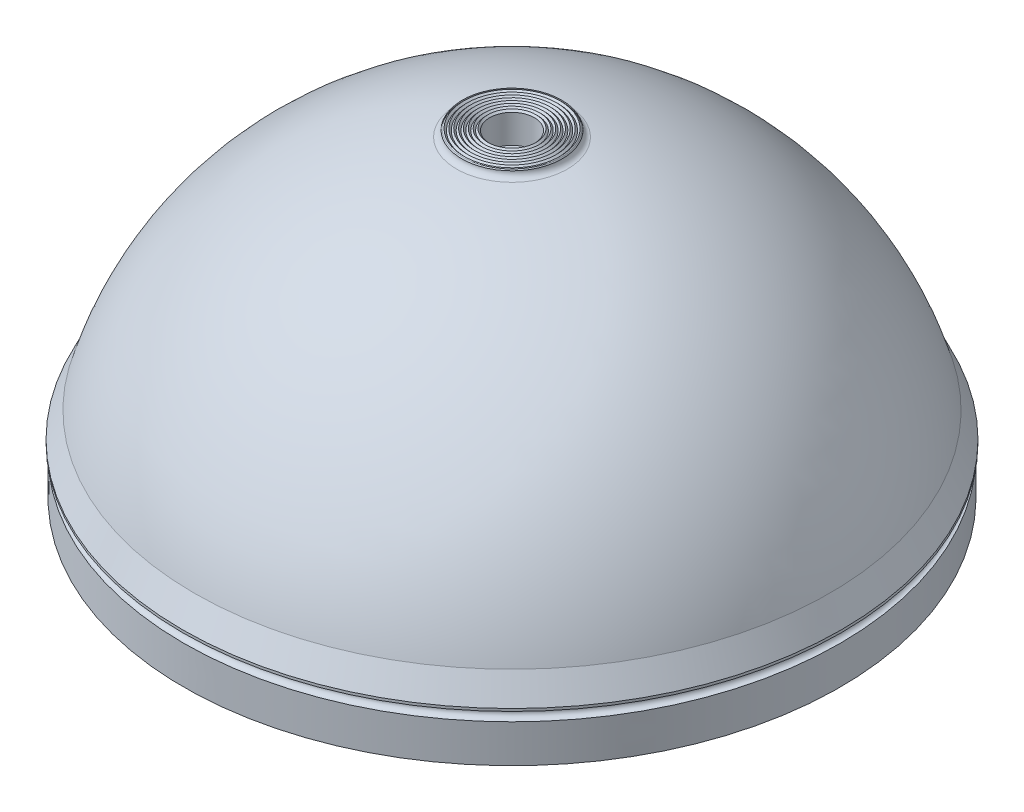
from build123d import *

# Parameters (mm, degrees)
SKETCH2_R          = 3.175
CUT_EXTRUDE3_DEPTH = 3.8608
CIRPATTERN1_COUNT  = 8


with BuildPart() as part:
    # Sketch1 → Base-Revolve (revolve)
    with BuildSketch(Plane.XY, mode=Mode.PRIVATE) as base_revolve_sk:
        with BuildLine():
            Line((-72.0598, 0), (-73.66, 0))
            Line((-73.66, 0), (-73.66, 3.175))
            Line((-73.66, 3.175), (-76.2, 3.175))
            Line((-76.2, 3.175), (-76.2, 5.2705))
            Line((-76.2, 5.2705), (-79.8068, 5.2705))
            Line((-79.8068, 5.2705), (-79.8068, 3.175))
            Line((-79.8068, 3.175), (-82.4738, 3.175))
            Line((-82.4738, 3.175), (-82.4992, 12.7508))
            ThreePointArc((-82.4992, 12.7508), (-81.21564549, 14.187568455), (-82.8294, 15.24))
            Line((-82.8294, 15.24), (-82.8294, 15.875))
            Line((-82.8294, 15.875), (-79.8322, 22.3012))
            ThreePointArc((-79.8322, 22.3012), (-55.503800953, 61.561160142), (-13.9446, 81.7118))
            ThreePointArc((-13.9446, 81.7118), (-12.994940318, 82.256595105), (-12.6238, 83.2866))
            Line((-12.6238, 83.2866), (-12.446, 83.566))
            Line((-12.446, 83.566), (-5.6134, 83.566))
            Line((-5.6134, 83.566), (-5.6134, 75.946))
            Line((-5.6134, 75.946), (-3.175, 75.946))
            Line((-3.175, 75.946), (-3.175, 74.041))
            Line((-3.175, 74.041), (-8.73125, 74.041))
            Line((-8.73125, 74.041), (-8.73125, 60.2488))
            Line((-8.73125, 60.2488), (-12.7, 60.2488))
            Line((-12.7, 60.2488), (-12.7, 72.9488))
            ThreePointArc((-12.7, 72.9488), (-13.429291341, 74.956349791), (-15.2654, 76.0476))
            ThreePointArc((-15.2654, 76.0476), (-50.460435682, 58.899681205), (-72.7964, 26.7462))
            ThreePointArc((-72.7964, 26.7462), (-73.49703435, 21.002889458), (-71.5772, 15.5448))
            Line((-71.5772, 15.5448), (-69.8373, 12.8016))
            Line((-69.8373, 12.8016), (-69.8373, 9.6266))
            Line((-69.8373, 9.6266), (-71.6026, 9.6266))
            Line((-71.6026, 9.6266), (-71.6026, 7.874))
            Line((-71.6026, 7.874), (-69.8373, 7.874))
            Line((-69.8373, 7.874), (-69.8373, 3.8608))
            Line((-69.8373, 3.8608), (-72.0598, 0))
        make_face()
    revolve(base_revolve_sk.sketch.rotate(Axis((0, 0, 0), (0, 1, 0)), 270), axis=Axis((0, 0, 0), (0, 1, 0)))

    # Sketch2 → Cut-Extrude3 (cut)
    with BuildSketch(Plane(origin=(0, 0, 0), x_dir=(1, 0, 0), z_dir=(0, 1, 0))):
        with Locations((0, 68.8467)):
            Circle(SKETCH2_R)
    cut_extrude3 = extrude(amount=CUT_EXTRUDE3_DEPTH, mode=Mode.SUBTRACT)

    # CirPattern1: Cut-Extrude3 ×8 about axis
    cirpattern1_axis = Axis((0, -50, 0), (0, 1, 0))
    for i in range(1, CIRPATTERN1_COUNT):
        add(cut_extrude3.rotate(cirpattern1_axis, i * 360 / CIRPATTERN1_COUNT), mode=Mode.SUBTRACT)

    # Sketch4 → Cut-Revolve1 (revolve, cut)
    with BuildSketch(Plane.XY, mode=Mode.PRIVATE) as cut_revolve1_sk:
        Polygon((-5.6134, 83.1342), (-6.045200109, 83.566), (-6.477, 83.1342), (-6.908799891, 83.566), (-7.3406, 83.1342), (-7.772400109, 83.566), (-8.2042, 83.1342), (-8.635999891, 83.566), (-9.0678, 83.1342), (-9.499600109, 83.566), (-9.9314, 83.1342), (-10.363199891, 83.566), (-10.795, 83.1342), (-11.226800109, 83.566), (-11.6586, 83.1342), (-12.090399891, 83.566), (-12.5222, 83.1342), (-12.446, 83.566), (-12.446, 83.9978), (-5.6134, 83.9978), (-5.6134, 83.566), align=None)
    revolve(cut_revolve1_sk.sketch.rotate(Axis((0, 76.2, 0), (0, 1, 0)), 270), axis=Axis((0, 76.2, 0), (0, 1, 0)), mode=Mode.SUBTRACT)


solid = part.part
